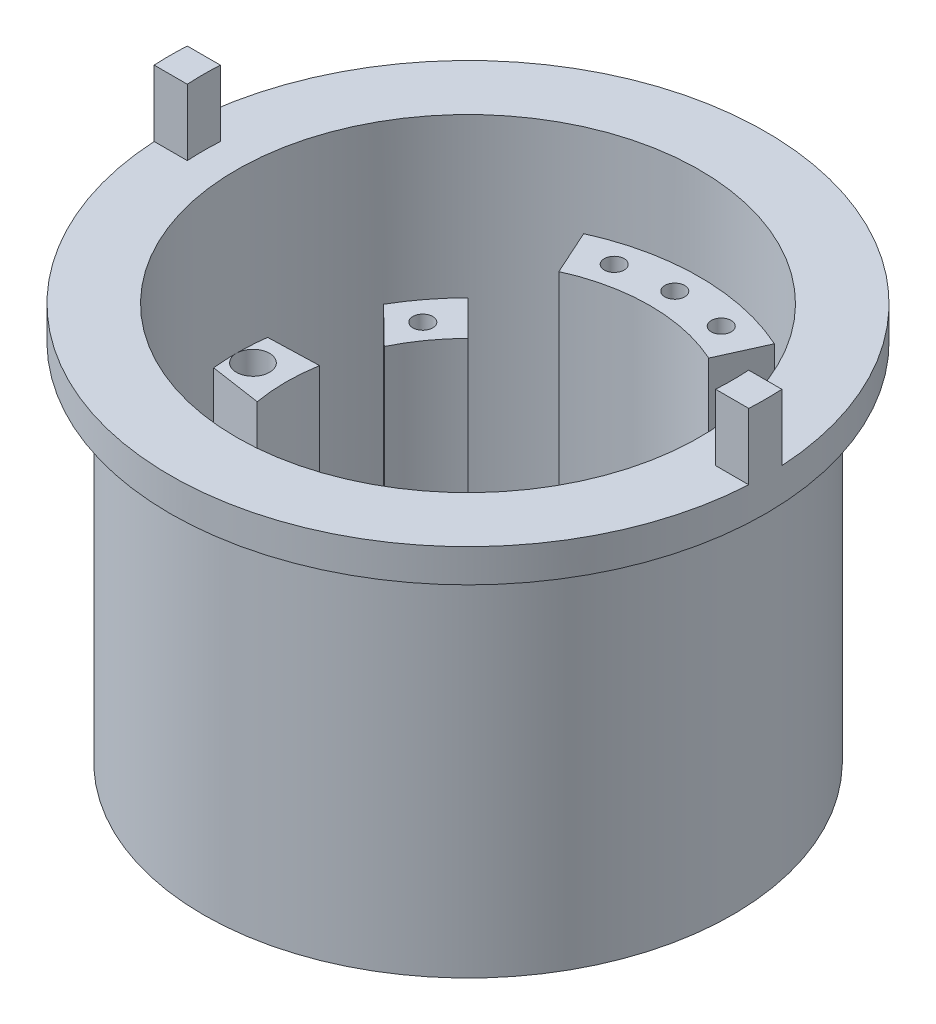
from build123d import *
from build123d.topology import SkipClean

# Parameters (mm, degrees)
SKETCH1_R           = 40
BOSS_EXTRUDE1_DEPTH = 5
CUT_EXTRUDE1_DEPTH  = 5
SKETCH3_R           = 40
SKETCH3_R_2         = 35
BOSS_EXTRUDE2_DEPTH = 50
BOSS_EXTRUDE4_DEPTH = 31
SKETCH5_R           = 2.5
CUT_EXTRUDE2_DEPTH  = 36
BOSS_EXTRUDE5_DEPTH = 41
SKETCH8_R           = 1.5
CUT_EXTRUDE3_DEPTH  = 25
SKETCH9_R           = 1.5
CUT_EXTRUDE4_DEPTH  = 30
SKETCH13_R          = 45
SKETCH13_R_2        = 35
BOSS_EXTRUDE6_DEPTH = 5
BOSS_EXTRUDE7_DEPTH = 10
CUT_EXTRUDE5_START  = -31
CUT_EXTRUDE5_DEPTH  = 31


with BuildPart() as part:
    # Sketch1 → Boss-Extrude1 (new body)
    with BuildSketch(Plane(origin=(0, 0, 0), x_dir=(1, 0, 0), z_dir=(0, 1, 0))):
        with Locations(Location((0, 0, 0), (0, 0, 270))):
            Circle(SKETCH1_R)
    extrude(amount=BOSS_EXTRUDE1_DEPTH)

    # Sketch2 → Cut-Extrude1 (cut)
    with BuildSketch(Plane(origin=(0, 5, 0), x_dir=(1, 0, 0), z_dir=(0, 1, 0))):
        Polygon((0, -10.066247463), (7.117911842, -7.117911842), (10.066247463, 0), (7.117911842, 7.117911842), (0, 10.066247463), (-7.117911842, 7.117911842), (-10.066247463, 0), (-7.117911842, -7.117911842), align=None)
    extrude(amount=-CUT_EXTRUDE1_DEPTH, mode=Mode.SUBTRACT)

    # Sketch3 → Boss-Extrude2 (add)
    with BuildSketch(Plane(origin=(0, 5, 0), x_dir=(1, 0, 0), z_dir=(0, 1, 0))):
        with Locations(Location((0, 0, 0), (0, 0, 270))):
            Circle(SKETCH3_R)
        with Locations(Location((0, 0, 0), (0, 0, 270))):
            Circle(SKETCH3_R_2, mode=Mode.SUBTRACT)
    extrude(amount=BOSS_EXTRUDE2_DEPTH)

    # Sketch4 → Boss-Extrude4 (add)
    with BuildSketch(Plane(origin=(0, 5, 0), x_dir=(1, 0, 0), z_dir=(0, 1, 0))):
        with BuildLine():
            Line((-19.445436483, 19.445436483), (-24.748737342, 24.748737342))
            ThreePointArc((-24.748737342, 24.748737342), (-35, 0), (-24.748737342, -24.748737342))
            Line((-24.748737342, -24.748737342), (-19.445436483, -19.445436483))
            ThreePointArc((-19.445436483, -19.445436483), (-27.5, 0), (-19.445436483, 19.445436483))
        make_face()
        with BuildLine():
            Line((19.445436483, -19.445436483), (24.748737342, -24.748737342))
            ThreePointArc((24.748737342, -24.748737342), (35, 0), (24.748737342, 24.748737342))
            Line((24.748737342, 24.748737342), (19.445436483, 19.445436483))
            ThreePointArc((19.445436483, 19.445436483), (27.5, 0), (19.445436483, -19.445436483))
        make_face()
    extrude(amount=BOSS_EXTRUDE4_DEPTH)

    # Sketch5 → Cut-Extrude2 (cut)
    with BuildSketch(Plane(origin=(0, 36, 0), x_dir=(1, 0, 0), z_dir=(0, 1, 0))):
        with Locations(Location((-32.5, 0, 0), (0, 0, 270))):
            Circle(SKETCH5_R)
    extrude(amount=-CUT_EXTRUDE2_DEPTH, mode=Mode.SUBTRACT)

    # Sketch7 → Boss-Extrude5 (add)
    with BuildSketch(Plane(origin=(0, 5, 0), x_dir=(1, 0, 0), z_dir=(0, 1, 0))):
        with BuildLine():
            Line((-14.410468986, 31.895742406), (-11.322511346, 25.060940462))
            ThreePointArc((-11.322511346, 25.060940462), (0, 27.5), (11.322511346, 25.060940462))
            Line((11.322511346, 25.060940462), (14.410468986, 31.895742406))
            ThreePointArc((14.410468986, 31.895742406), (0, 35), (-14.410468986, 31.895742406))
        make_face()
        with BuildLine():
            Line((-11.322511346, -25.060940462), (-14.410468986, -31.895742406))
            ThreePointArc((-14.410468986, -31.895742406), (0, -35), (14.410468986, -31.895742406))
            Line((14.410468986, -31.895742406), (11.322511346, -25.060940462))
            ThreePointArc((11.322511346, -25.060940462), (0, -27.5), (-11.322511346, -25.060940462))
        make_face()
    extrude(amount=BOSS_EXTRUDE5_DEPTH)

    # Sketch8 → Cut-Extrude3 (cut)
    with BuildSketch(Plane(origin=(0, 36, 0), x_dir=(1, 0, 0), z_dir=(0, 1, 0))):
        with Locations(Location((30.879859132, 0, 0), (0, 0, 270))):
            Circle(SKETCH8_R)
        with Locations(Location((24.982330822, -18.150725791, 0), (0, 0, 270))):
            Circle(SKETCH8_R)
        with Locations(Location((-24.982330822, -18.150725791, 0), (0, 0, 270))):
            Circle(SKETCH8_R)
        with Locations(Location((-24.982330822, 18.150725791, 0), (0, 0, 270))):
            Circle(SKETCH8_R)
        with Locations(Location((24.982330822, 18.150725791, 0), (0, 0, 270))):
            Circle(SKETCH8_R)
    extrude(amount=-CUT_EXTRUDE3_DEPTH, mode=Mode.SUBTRACT)

    # Sketch9 → Cut-Extrude4 (cut)
    with BuildSketch(Plane(origin=(0, 46, 0), x_dir=(1, 0, 0), z_dir=(0, 1, 0))):
        with Locations(Location((0, 31.25, 0), (0, 0, 270))):
            Circle(SKETCH9_R)
        with Locations(Location((8.088095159, 30.185182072, 0), (0, 0, 270))):
            Circle(SKETCH9_R)
        with Locations(Location((8.088095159, -30.185182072, 0), (0, 0, 270))):
            Circle(SKETCH9_R)
        with Locations(Location((0, -31.25, 0), (0, 0, 270))):
            Circle(SKETCH9_R)
        with Locations(Location((-8.088095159, -30.185182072, 0), (0, 0, 270))):
            Circle(SKETCH9_R)
        with Locations(Location((-8.088095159, 30.185182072, 0), (0, 0, 270))):
            Circle(SKETCH9_R)
    extrude(amount=-CUT_EXTRUDE4_DEPTH, mode=Mode.SUBTRACT)

    # Sketch13 → Boss-Extrude6 (add)
    with BuildSketch(Plane(origin=(0, 55, 0), x_dir=(1, 0, 0), z_dir=(0, 1, 0))):
        with Locations(Location((0, 0, 0), (0, 0, 270))):
            Circle(SKETCH13_R)
        with Locations(Location((0, 0, 0), (0, 0, 114.313411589))):
            Circle(SKETCH13_R_2, mode=Mode.SUBTRACT)
    extrude(amount=BOSS_EXTRUDE6_DEPTH)

    # Sketch14 → Boss-Extrude7 (add)
    with SkipClean():  # the faces are left unmerged after this step: merging them gives an invalid solid
        with BuildSketch(Plane(origin=(0, 60, 0), x_dir=(1, 0, 0), z_dir=(0, 1, 0))):
            with BuildLine():
                Line((-44.930501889, 2.5), (-39.921798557, 2.5))
                ThreePointArc((-39.921798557, 2.5), (-40, 0), (-39.921798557, -2.5))
                Line((-39.921798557, -2.5), (-44.930501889, -2.5))
                ThreePointArc((-44.930501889, -2.5), (-45, 0), (-44.930501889, 2.5))
            make_face()
            with BuildLine():
                Line((39.921798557, 2.5), (44.930501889, 2.5))
                ThreePointArc((44.930501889, 2.5), (45, 0), (44.930501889, -2.5))
                Line((44.930501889, -2.5), (39.921798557, -2.5))
                ThreePointArc((39.921798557, -2.5), (40, 0), (39.921798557, 2.5))
            make_face()
        extrude(amount=BOSS_EXTRUDE7_DEPTH)

    # Sketch15 → Cut-Extrude5 (cut)
    with SkipClean():  # the faces are left unmerged after this step: merging them gives an invalid solid
        with BuildSketch(Plane(origin=(0, 36, 0), x_dir=(1, 0, 0), z_dir=(0, 1, 0)).offset(CUT_EXTRUDE5_START)):
            with BuildLine():
                Line((24.670555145, 12.149638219), (30.693854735, 16.819253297))
                ThreePointArc((30.693854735, 16.819253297), (33.410066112, 10.42916499), (34.811392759, 3.628627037))
                Line((34.811392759, 3.628627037), (27.083242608, 4.769483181))
                ThreePointArc((27.083242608, 4.769483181), (26.13867953, 8.545140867), (24.670555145, 12.149638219))
            make_face()
            with BuildLine():
                Line((24.714235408, -12.060537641), (30.295861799, -17.526002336))
                ThreePointArc((30.295861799, -17.526002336), (33.159420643, -11.200572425), (34.717959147, -4.434333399))
                Line((34.717959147, -4.434333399), (27.100276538, -4.671724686))
                ThreePointArc((27.100276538, -4.671724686), (26.169343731, -8.450766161), (24.714235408, -12.060537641))
            make_face()
            with BuildLine():
                Line((-27.083242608, -4.769483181), (-34.811392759, -3.628627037))
                ThreePointArc((-34.811392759, -3.628627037), (-33.410066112, -10.42916499), (-30.693854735, -16.819253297))
                Line((-30.693854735, -16.819253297), (-24.670555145, -12.149638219))
                ThreePointArc((-24.670555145, -12.149638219), (-26.13867953, -8.545140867), (-27.083242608, -4.769483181))
            make_face()
            with BuildLine():
                Line((-24.714235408, 12.060537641), (-30.295861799, 17.526002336))
                ThreePointArc((-30.295861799, 17.526002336), (-33.159420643, 11.200572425), (-34.717959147, 4.434333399))
                Line((-34.717959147, 4.434333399), (-27.100276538, 4.671724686))
                ThreePointArc((-27.100276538, 4.671724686), (-26.169343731, 8.450766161), (-24.714235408, 12.060537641))
            make_face()
        extrude(amount=CUT_EXTRUDE5_DEPTH, mode=Mode.SUBTRACT)


solid = part.part
